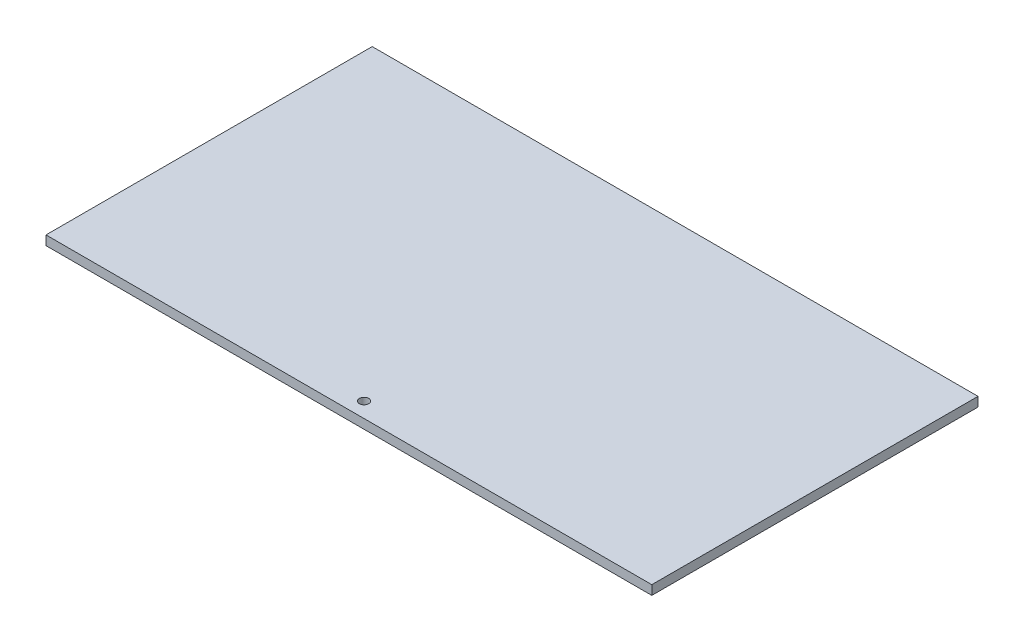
from build123d import *

# Parameters (mm, degrees)
SKETCH1_W           = 130
SKETCH1_H           = 70
BOSS_EXTRUDE1_DEPTH = 2
SKETCH2_R           = 1
CUT_EXTRUDE1_DEPTH  = 2


with BuildPart() as part:
    # Sketch1 → Boss-Extrude1 (new body)
    with BuildSketch(Plane(origin=(0, 0, 0), x_dir=(1, 0, 0), z_dir=(0, 1, 0))):
        Rectangle(SKETCH1_W, SKETCH1_H)
    extrude(amount=BOSS_EXTRUDE1_DEPTH)

    # Sketch2 → Cut-Extrude1 (cut)
    with BuildSketch(Plane(origin=(0, 2, 0), x_dir=(1, 0, 0), z_dir=(0, 1, 0))):
        with Locations(Location((0, -31.753069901, 0), (0, 0, 270))):
            Circle(SKETCH2_R)
    extrude(amount=-CUT_EXTRUDE1_DEPTH, mode=Mode.SUBTRACT)


solid = part.part
